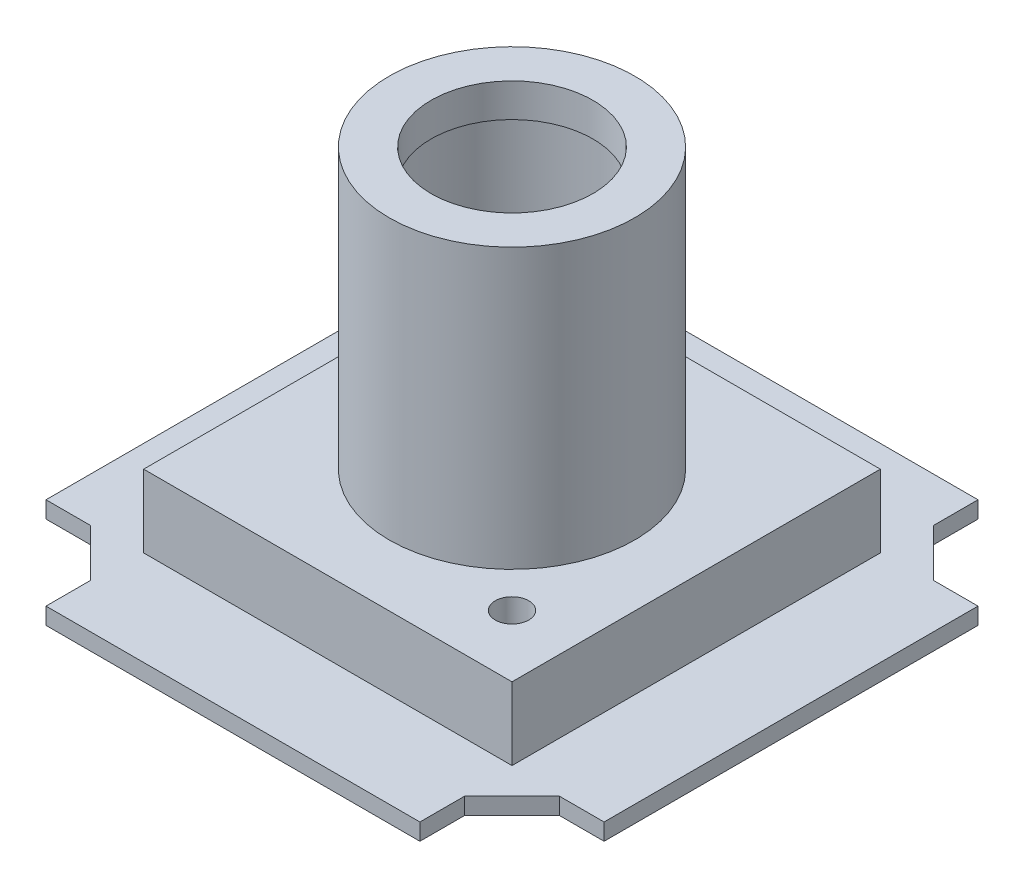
ISO-10303-21;
HEADER;
FILE_DESCRIPTION(('STEP AP214'),'2;1');
FILE_NAME('part.step','',(''),(''),'','','');
FILE_SCHEMA(('AUTOMOTIVE_DESIGN { 1 0 10303 214 1 1 1 1 }'));
ENDSEC;
DATA;
#1=APPLICATION_CONTEXT('core data for automotive mechanical design processes');
#2=APPLICATION_PROTOCOL_DEFINITION('international standard','automotive_design',2000,#1);
#3=PRODUCT_CONTEXT('',#1,'mechanical');
#4=PRODUCT('Part','Part','',(#3));
#5=PRODUCT_RELATED_PRODUCT_CATEGORY('part','',(#4));
#6=PRODUCT_DEFINITION_FORMATION('','',#4);
#7=PRODUCT_DEFINITION_CONTEXT('part definition',#1,'design');
#8=PRODUCT_DEFINITION('design','',#6,#7);
#9=PRODUCT_DEFINITION_SHAPE('','',#8);
#10=(LENGTH_UNIT() NAMED_UNIT(*) SI_UNIT(.MILLI.,.METRE.));
#11=(NAMED_UNIT(*) PLANE_ANGLE_UNIT() SI_UNIT($,.RADIAN.));
#12=(NAMED_UNIT(*) SI_UNIT($,.STERADIAN.) SOLID_ANGLE_UNIT());
#13=UNCERTAINTY_MEASURE_WITH_UNIT(LENGTH_MEASURE(1.E-05),#10,'distance_accuracy_value','');
#14=(GEOMETRIC_REPRESENTATION_CONTEXT(3) GLOBAL_UNCERTAINTY_ASSIGNED_CONTEXT((#13)) GLOBAL_UNIT_ASSIGNED_CONTEXT((#10,
#11,#12)) REPRESENTATION_CONTEXT('',''));
#15=CARTESIAN_POINT('',(0.,0.,0.));
#16=DIRECTION('',(0.,0.,1.));
#17=DIRECTION('',(1.,0.,0.));
#18=AXIS2_PLACEMENT_3D('',#15,#16,#17);
#19=CARTESIAN_POINT('',(0.,8.,16.5));
#20=DIRECTION('',(0.,0.,-1.));
#21=DIRECTION('',(-1.,0.,0.));
#22=AXIS2_PLACEMENT_3D('',#19,#20,#21);
#23=PLANE('',#22);
#24=DIRECTION('',(0.,-1.,0.));
#25=VECTOR('',#24,1.);
#26=CARTESIAN_POINT('',(-16.5,8.,16.5));
#27=LINE('',#26,#25);
#28=CARTESIAN_POINT('',(-16.5,8.,16.5));
#29=VERTEX_POINT('',#28);
#30=CARTESIAN_POINT('',(-16.5,1.5,16.5));
#31=VERTEX_POINT('',#30);
#32=EDGE_CURVE('E200',#29,#31,#27,.T.);
#33=ORIENTED_EDGE('',*,*,#32,.T.);
#34=DIRECTION('',(1.,0.,0.));
#35=VECTOR('',#34,1.);
#36=CARTESIAN_POINT('',(0.,1.5,16.5));
#37=LINE('',#36,#35);
#38=CARTESIAN_POINT('',(16.5,1.5,16.5));
#39=VERTEX_POINT('',#38);
#40=EDGE_CURVE('E66',#31,#39,#37,.T.);
#41=ORIENTED_EDGE('',*,*,#40,.T.);
#42=DIRECTION('',(0.,-1.,0.));
#43=VECTOR('',#42,1.);
#44=CARTESIAN_POINT('',(16.5,8.,16.5));
#45=LINE('',#44,#43);
#46=CARTESIAN_POINT('',(16.5,8.,16.5));
#47=VERTEX_POINT('',#46);
#48=EDGE_CURVE('E12',#47,#39,#45,.T.);
#49=ORIENTED_EDGE('',*,*,#48,.F.);
#50=DIRECTION('',(1.,0.,0.));
#51=VECTOR('',#50,1.);
#52=CARTESIAN_POINT('',(0.,8.,16.5));
#53=LINE('',#52,#51);
#54=EDGE_CURVE('E391',#29,#47,#53,.T.);
#55=ORIENTED_EDGE('',*,*,#54,.F.);
#56=EDGE_LOOP('',(#33,#41,#49,#55));
#57=FACE_BOUND('',#56,.T.);
#58=ADVANCED_FACE('F51',(#57),#23,.F.);
#59=CARTESIAN_POINT('',(16.5,8.,0.));
#60=DIRECTION('',(-1.,0.,0.));
#61=DIRECTION('',(0.,0.,1.));
#62=AXIS2_PLACEMENT_3D('',#59,#60,#61);
#63=PLANE('',#62);
#64=ORIENTED_EDGE('',*,*,#48,.T.);
#65=DIRECTION('',(0.,0.,-1.));
#66=VECTOR('',#65,1.);
#67=CARTESIAN_POINT('',(16.5,1.5,0.));
#68=LINE('',#67,#66);
#69=CARTESIAN_POINT('',(16.5,1.5,-16.5));
#70=VERTEX_POINT('',#69);
#71=EDGE_CURVE('E72',#39,#70,#68,.T.);
#72=ORIENTED_EDGE('',*,*,#71,.T.);
#73=DIRECTION('',(0.,-1.,0.));
#74=VECTOR('',#73,1.);
#75=CARTESIAN_POINT('',(16.5,8.,-16.5));
#76=LINE('',#75,#74);
#77=CARTESIAN_POINT('',(16.5,8.,-16.5));
#78=VERTEX_POINT('',#77);
#79=EDGE_CURVE('E59',#78,#70,#76,.T.);
#80=ORIENTED_EDGE('',*,*,#79,.F.);
#81=DIRECTION('',(0.,0.,-1.));
#82=VECTOR('',#81,1.);
#83=CARTESIAN_POINT('',(16.5,8.,0.));
#84=LINE('',#83,#82);
#85=EDGE_CURVE('E395',#47,#78,#84,.T.);
#86=ORIENTED_EDGE('',*,*,#85,.F.);
#87=EDGE_LOOP('',(#64,#72,#80,#86));
#88=FACE_BOUND('',#87,.T.);
#89=ADVANCED_FACE('F408',(#88),#63,.F.);
#90=CARTESIAN_POINT('',(0.,8.,-16.5));
#91=DIRECTION('',(0.,0.,-1.));
#92=DIRECTION('',(-1.,0.,0.));
#93=AXIS2_PLACEMENT_3D('',#90,#91,#92);
#94=PLANE('',#93);
#95=DIRECTION('',(1.,0.,0.));
#96=VECTOR('',#95,1.);
#97=CARTESIAN_POINT('',(0.,1.5,-16.5));
#98=LINE('',#97,#96);
#99=CARTESIAN_POINT('',(-16.5,1.5,-16.5));
#100=VERTEX_POINT('',#99);
#101=EDGE_CURVE('E203',#100,#70,#98,.T.);
#102=ORIENTED_EDGE('',*,*,#101,.F.);
#103=DIRECTION('',(0.,-1.,0.));
#104=VECTOR('',#103,1.);
#105=CARTESIAN_POINT('',(-16.5,8.,-16.5));
#106=LINE('',#105,#104);
#107=CARTESIAN_POINT('',(-16.5,8.,-16.5));
#108=VERTEX_POINT('',#107);
#109=EDGE_CURVE('E189',#108,#100,#106,.T.);
#110=ORIENTED_EDGE('',*,*,#109,.F.);
#111=DIRECTION('',(1.,0.,0.));
#112=VECTOR('',#111,1.);
#113=CARTESIAN_POINT('',(0.,8.,-16.5));
#114=LINE('',#113,#112);
#115=EDGE_CURVE('E398',#108,#78,#114,.T.);
#116=ORIENTED_EDGE('',*,*,#115,.T.);
#117=ORIENTED_EDGE('',*,*,#79,.T.);
#118=EDGE_LOOP('',(#102,#110,#116,#117));
#119=FACE_BOUND('',#118,.T.);
#120=ADVANCED_FACE('F204',(#119),#94,.T.);
#121=CARTESIAN_POINT('',(-16.5,8.,0.));
#122=DIRECTION('',(-1.,0.,0.));
#123=DIRECTION('',(0.,0.,1.));
#124=AXIS2_PLACEMENT_3D('',#121,#122,#123);
#125=PLANE('',#124);
#126=DIRECTION('',(0.,0.,-1.));
#127=VECTOR('',#126,1.);
#128=CARTESIAN_POINT('',(-16.5,1.5,0.));
#129=LINE('',#128,#127);
#130=EDGE_CURVE('E193',#31,#100,#129,.T.);
#131=ORIENTED_EDGE('',*,*,#130,.F.);
#132=ORIENTED_EDGE('',*,*,#32,.F.);
#133=DIRECTION('',(0.,0.,-1.));
#134=VECTOR('',#133,1.);
#135=CARTESIAN_POINT('',(-16.5,8.,0.));
#136=LINE('',#135,#134);
#137=EDGE_CURVE('E195',#29,#108,#136,.T.);
#138=ORIENTED_EDGE('',*,*,#137,.T.);
#139=ORIENTED_EDGE('',*,*,#109,.T.);
#140=EDGE_LOOP('',(#131,#132,#138,#139));
#141=FACE_BOUND('',#140,.T.);
#142=ADVANCED_FACE('F191',(#141),#125,.T.);
#143=CARTESIAN_POINT('',(0.,8.,0.));
#144=DIRECTION('',(0.,1.,0.));
#145=DIRECTION('',(0.,0.,1.));
#146=AXIS2_PLACEMENT_3D('',#143,#144,#145);
#147=PLANE('',#146);
#148=CARTESIAN_POINT('',(0.,8.,0.));
#149=DIRECTION('',(0.,1.,0.));
#150=DIRECTION('',(0.,0.,1.));
#151=AXIS2_PLACEMENT_3D('',#148,#149,#150);
#152=CIRCLE('',#151,11.);
#153=CARTESIAN_POINT('',(0.,8.,11.));
#154=VERTEX_POINT('',#153);
#155=EDGE_CURVE('E541',#154,#154,#152,.T.);
#156=ORIENTED_EDGE('',*,*,#155,.F.);
#157=EDGE_LOOP('',(#156));
#158=FACE_BOUND('',#157,.T.);
#159=CARTESIAN_POINT('',(-10.9601551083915,8.,-10.9601551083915));
#160=DIRECTION('',(0.,1.,0.));
#161=DIRECTION('',(0.,0.,1.));
#162=AXIS2_PLACEMENT_3D('',#159,#160,#161);
#163=CIRCLE('',#162,1.5);
#164=CARTESIAN_POINT('',(-10.9601551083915,8.,-9.46015510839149));
#165=VERTEX_POINT('',#164);
#166=EDGE_CURVE('E284',#165,#165,#163,.T.);
#167=ORIENTED_EDGE('',*,*,#166,.F.);
#168=EDGE_LOOP('',(#167));
#169=FACE_BOUND('',#168,.T.);
#170=CARTESIAN_POINT('',(10.9601551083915,8.,10.9601551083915));
#171=DIRECTION('',(0.,1.,0.));
#172=DIRECTION('',(0.,0.,1.));
#173=AXIS2_PLACEMENT_3D('',#170,#171,#172);
#174=CIRCLE('',#173,1.5);
#175=CARTESIAN_POINT('',(10.9601551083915,8.,12.4601551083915));
#176=VERTEX_POINT('',#175);
#177=EDGE_CURVE('E554',#176,#176,#174,.T.);
#178=ORIENTED_EDGE('',*,*,#177,.F.);
#179=EDGE_LOOP('',(#178));
#180=FACE_BOUND('',#179,.T.);
#181=ORIENTED_EDGE('',*,*,#54,.T.);
#182=ORIENTED_EDGE('',*,*,#85,.T.);
#183=ORIENTED_EDGE('',*,*,#115,.F.);
#184=ORIENTED_EDGE('',*,*,#137,.F.);
#185=EDGE_LOOP('',(#181,#182,#183,#184));
#186=FACE_BOUND('',#185,.T.);
#187=ADVANCED_FACE('F407',(#158,#169,#180,#186),#147,.T.);
#188=CARTESIAN_POINT('',(0.,1.5,-16.75));
#189=DIRECTION('',(0.,0.,-1.));
#190=DIRECTION('',(-1.,0.,0.));
#191=AXIS2_PLACEMENT_3D('',#188,#189,#190);
#192=PLANE('',#191);
#193=DIRECTION('',(1.,0.,0.));
#194=VECTOR('',#193,1.);
#195=CARTESIAN_POINT('',(0.,0.,-16.75));
#196=LINE('',#195,#194);
#197=CARTESIAN_POINT('',(-25.,0.,-16.75));
#198=VERTEX_POINT('',#197);
#199=CARTESIAN_POINT('',(-21.,0.,-16.75));
#200=VERTEX_POINT('',#199);
#201=EDGE_CURVE('E279',#198,#200,#196,.T.);
#202=ORIENTED_EDGE('',*,*,#201,.F.);
#203=DIRECTION('',(0.,-1.,0.));
#204=VECTOR('',#203,1.);
#205=CARTESIAN_POINT('',(-25.,1.5,-16.75));
#206=LINE('',#205,#204);
#207=CARTESIAN_POINT('',(-25.,1.5,-16.75));
#208=VERTEX_POINT('',#207);
#209=EDGE_CURVE('E388',#208,#198,#206,.T.);
#210=ORIENTED_EDGE('',*,*,#209,.F.);
#211=DIRECTION('',(1.,0.,0.));
#212=VECTOR('',#211,1.);
#213=CARTESIAN_POINT('',(0.,1.5,-16.75));
#214=LINE('',#213,#212);
#215=CARTESIAN_POINT('',(-21.,1.5,-16.75));
#216=VERTEX_POINT('',#215);
#217=EDGE_CURVE('E207',#208,#216,#214,.T.);
#218=ORIENTED_EDGE('',*,*,#217,.T.);
#219=DIRECTION('',(0.,-1.,0.));
#220=VECTOR('',#219,1.);
#221=CARTESIAN_POINT('',(-21.,1.5,-16.75));
#222=LINE('',#221,#220);
#223=EDGE_CURVE('E278',#216,#200,#222,.T.);
#224=ORIENTED_EDGE('',*,*,#223,.T.);
#225=EDGE_LOOP('',(#202,#210,#218,#224));
#226=FACE_BOUND('',#225,.T.);
#227=ADVANCED_FACE('F425',(#226),#192,.T.);
#228=CARTESIAN_POINT('',(-25.,1.5,0.));
#229=DIRECTION('',(1.,0.,0.));
#230=DIRECTION('',(0.,0.,-1.));
#231=AXIS2_PLACEMENT_3D('',#228,#229,#230);
#232=PLANE('',#231);
#233=DIRECTION('',(0.,0.,1.));
#234=VECTOR('',#233,1.);
#235=CARTESIAN_POINT('',(-25.,0.,0.));
#236=LINE('',#235,#234);
#237=CARTESIAN_POINT('',(-25.,0.,16.75));
#238=VERTEX_POINT('',#237);
#239=EDGE_CURVE('E283',#198,#238,#236,.T.);
#240=ORIENTED_EDGE('',*,*,#239,.T.);
#241=DIRECTION('',(0.,-1.,0.));
#242=VECTOR('',#241,1.);
#243=CARTESIAN_POINT('',(-25.,1.5,16.75));
#244=LINE('',#243,#242);
#245=CARTESIAN_POINT('',(-25.,1.5,16.75));
#246=VERTEX_POINT('',#245);
#247=EDGE_CURVE('E385',#246,#238,#244,.T.);
#248=ORIENTED_EDGE('',*,*,#247,.F.);
#249=DIRECTION('',(0.,0.,1.));
#250=VECTOR('',#249,1.);
#251=CARTESIAN_POINT('',(-25.,1.5,0.));
#252=LINE('',#251,#250);
#253=EDGE_CURVE('E220',#208,#246,#252,.T.);
#254=ORIENTED_EDGE('',*,*,#253,.F.);
#255=ORIENTED_EDGE('',*,*,#209,.T.);
#256=EDGE_LOOP('',(#240,#248,#254,#255));
#257=FACE_BOUND('',#256,.T.);
#258=ADVANCED_FACE('F429',(#257),#232,.F.);
#259=CARTESIAN_POINT('',(0.,1.5,16.75));
#260=DIRECTION('',(0.,0.,1.));
#261=DIRECTION('',(1.,0.,0.));
#262=AXIS2_PLACEMENT_3D('',#259,#260,#261);
#263=PLANE('',#262);
#264=DIRECTION('',(-1.,0.,0.));
#265=VECTOR('',#264,1.);
#266=CARTESIAN_POINT('',(0.,0.,16.75));
#267=LINE('',#266,#265);
#268=CARTESIAN_POINT('',(-21.,0.,16.75));
#269=VERTEX_POINT('',#268);
#270=EDGE_CURVE('E288',#269,#238,#267,.T.);
#271=ORIENTED_EDGE('',*,*,#270,.F.);
#272=DIRECTION('',(0.,-1.,0.));
#273=VECTOR('',#272,1.);
#274=CARTESIAN_POINT('',(-21.,1.5,16.75));
#275=LINE('',#274,#273);
#276=CARTESIAN_POINT('',(-21.,1.5,16.75));
#277=VERTEX_POINT('',#276);
#278=EDGE_CURVE('E382',#277,#269,#275,.T.);
#279=ORIENTED_EDGE('',*,*,#278,.F.);
#280=DIRECTION('',(-1.,0.,0.));
#281=VECTOR('',#280,1.);
#282=CARTESIAN_POINT('',(0.,1.5,16.75));
#283=LINE('',#282,#281);
#284=EDGE_CURVE('E223',#277,#246,#283,.T.);
#285=ORIENTED_EDGE('',*,*,#284,.T.);
#286=ORIENTED_EDGE('',*,*,#247,.T.);
#287=EDGE_LOOP('',(#271,#279,#285,#286));
#288=FACE_BOUND('',#287,.T.);
#289=ADVANCED_FACE('F433',(#288),#263,.T.);
#290=CARTESIAN_POINT('',(-18.875,1.5,18.875));
#291=DIRECTION('',(-0.707106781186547,0.,0.707106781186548));
#292=DIRECTION('',(0.707106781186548,0.,0.707106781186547));
#293=AXIS2_PLACEMENT_3D('',#290,#291,#292);
#294=PLANE('',#293);
#295=DIRECTION('',(-0.707106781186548,0.,-0.707106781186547));
#296=VECTOR('',#295,1.);
#297=CARTESIAN_POINT('',(-18.875,0.,18.875));
#298=LINE('',#297,#296);
#299=CARTESIAN_POINT('',(-16.75,0.,21.));
#300=VERTEX_POINT('',#299);
#301=EDGE_CURVE('E292',#300,#269,#298,.T.);
#302=ORIENTED_EDGE('',*,*,#301,.F.);
#303=DIRECTION('',(0.,-1.,0.));
#304=VECTOR('',#303,1.);
#305=CARTESIAN_POINT('',(-16.75,1.5,21.));
#306=LINE('',#305,#304);
#307=CARTESIAN_POINT('',(-16.75,1.5,21.));
#308=VERTEX_POINT('',#307);
#309=EDGE_CURVE('E379',#308,#300,#306,.T.);
#310=ORIENTED_EDGE('',*,*,#309,.F.);
#311=DIRECTION('',(-0.707106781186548,0.,-0.707106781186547));
#312=VECTOR('',#311,1.);
#313=CARTESIAN_POINT('',(-18.875,1.5,18.875));
#314=LINE('',#313,#312);
#315=EDGE_CURVE('E227',#308,#277,#314,.T.);
#316=ORIENTED_EDGE('',*,*,#315,.T.);
#317=ORIENTED_EDGE('',*,*,#278,.T.);
#318=EDGE_LOOP('',(#302,#310,#316,#317));
#319=FACE_BOUND('',#318,.T.);
#320=ADVANCED_FACE('F437',(#319),#294,.T.);
#321=CARTESIAN_POINT('',(-16.75,1.5,0.));
#322=DIRECTION('',(-1.,0.,0.));
#323=DIRECTION('',(0.,0.,1.));
#324=AXIS2_PLACEMENT_3D('',#321,#322,#323);
#325=PLANE('',#324);
#326=DIRECTION('',(0.,0.,-1.));
#327=VECTOR('',#326,1.);
#328=CARTESIAN_POINT('',(-16.75,0.,0.));
#329=LINE('',#328,#327);
#330=CARTESIAN_POINT('',(-16.75,0.,25.));
#331=VERTEX_POINT('',#330);
#332=EDGE_CURVE('E296',#331,#300,#329,.T.);
#333=ORIENTED_EDGE('',*,*,#332,.F.);
#334=DIRECTION('',(0.,-1.,0.));
#335=VECTOR('',#334,1.);
#336=CARTESIAN_POINT('',(-16.75,1.5,25.));
#337=LINE('',#336,#335);
#338=CARTESIAN_POINT('',(-16.75,1.5,25.));
#339=VERTEX_POINT('',#338);
#340=EDGE_CURVE('E376',#339,#331,#337,.T.);
#341=ORIENTED_EDGE('',*,*,#340,.F.);
#342=DIRECTION('',(0.,0.,-1.));
#343=VECTOR('',#342,1.);
#344=CARTESIAN_POINT('',(-16.75,1.5,0.));
#345=LINE('',#344,#343);
#346=EDGE_CURVE('E231',#339,#308,#345,.T.);
#347=ORIENTED_EDGE('',*,*,#346,.T.);
#348=ORIENTED_EDGE('',*,*,#309,.T.);
#349=EDGE_LOOP('',(#333,#341,#347,#348));
#350=FACE_BOUND('',#349,.T.);
#351=ADVANCED_FACE('F441',(#350),#325,.T.);
#352=CARTESIAN_POINT('',(0.,1.5,25.));
#353=DIRECTION('',(0.,0.,1.));
#354=DIRECTION('',(1.,0.,0.));
#355=AXIS2_PLACEMENT_3D('',#352,#353,#354);
#356=PLANE('',#355);
#357=DIRECTION('',(-1.,0.,0.));
#358=VECTOR('',#357,1.);
#359=CARTESIAN_POINT('',(0.,0.,25.));
#360=LINE('',#359,#358);
#361=CARTESIAN_POINT('',(16.75,0.,25.));
#362=VERTEX_POINT('',#361);
#363=EDGE_CURVE('E300',#362,#331,#360,.T.);
#364=ORIENTED_EDGE('',*,*,#363,.F.);
#365=DIRECTION('',(0.,-1.,0.));
#366=VECTOR('',#365,1.);
#367=CARTESIAN_POINT('',(16.75,1.5,25.));
#368=LINE('',#367,#366);
#369=CARTESIAN_POINT('',(16.75,1.5,25.));
#370=VERTEX_POINT('',#369);
#371=EDGE_CURVE('E373',#370,#362,#368,.T.);
#372=ORIENTED_EDGE('',*,*,#371,.F.);
#373=DIRECTION('',(-1.,0.,0.));
#374=VECTOR('',#373,1.);
#375=CARTESIAN_POINT('',(0.,1.5,25.));
#376=LINE('',#375,#374);
#377=EDGE_CURVE('E235',#370,#339,#376,.T.);
#378=ORIENTED_EDGE('',*,*,#377,.T.);
#379=ORIENTED_EDGE('',*,*,#340,.T.);
#380=EDGE_LOOP('',(#364,#372,#378,#379));
#381=FACE_BOUND('',#380,.T.);
#382=ADVANCED_FACE('F445',(#381),#356,.T.);
#383=CARTESIAN_POINT('',(16.75,1.5,0.));
#384=DIRECTION('',(1.,0.,0.));
#385=DIRECTION('',(0.,0.,-1.));
#386=AXIS2_PLACEMENT_3D('',#383,#384,#385);
#387=PLANE('',#386);
#388=DIRECTION('',(0.,0.,1.));
#389=VECTOR('',#388,1.);
#390=CARTESIAN_POINT('',(16.75,0.,0.));
#391=LINE('',#390,#389);
#392=CARTESIAN_POINT('',(16.75,0.,21.));
#393=VERTEX_POINT('',#392);
#394=EDGE_CURVE('E304',#393,#362,#391,.T.);
#395=ORIENTED_EDGE('',*,*,#394,.F.);
#396=DIRECTION('',(0.,-1.,0.));
#397=VECTOR('',#396,1.);
#398=CARTESIAN_POINT('',(16.75,1.5,21.));
#399=LINE('',#398,#397);
#400=CARTESIAN_POINT('',(16.75,1.5,21.));
#401=VERTEX_POINT('',#400);
#402=EDGE_CURVE('E370',#401,#393,#399,.T.);
#403=ORIENTED_EDGE('',*,*,#402,.F.);
#404=DIRECTION('',(0.,0.,1.));
#405=VECTOR('',#404,1.);
#406=CARTESIAN_POINT('',(16.75,1.5,0.));
#407=LINE('',#406,#405);
#408=EDGE_CURVE('E239',#401,#370,#407,.T.);
#409=ORIENTED_EDGE('',*,*,#408,.T.);
#410=ORIENTED_EDGE('',*,*,#371,.T.);
#411=EDGE_LOOP('',(#395,#403,#409,#410));
#412=FACE_BOUND('',#411,.T.);
#413=ADVANCED_FACE('F449',(#412),#387,.T.);
#414=CARTESIAN_POINT('',(18.875,1.5,18.875));
#415=DIRECTION('',(0.707106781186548,0.,0.707106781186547));
#416=DIRECTION('',(0.707106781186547,0.,-0.707106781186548));
#417=AXIS2_PLACEMENT_3D('',#414,#415,#416);
#418=PLANE('',#417);
#419=DIRECTION('',(-0.707106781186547,0.,0.707106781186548));
#420=VECTOR('',#419,1.);
#421=CARTESIAN_POINT('',(18.875,0.,18.875));
#422=LINE('',#421,#420);
#423=CARTESIAN_POINT('',(21.,0.,16.75));
#424=VERTEX_POINT('',#423);
#425=EDGE_CURVE('E308',#424,#393,#422,.T.);
#426=ORIENTED_EDGE('',*,*,#425,.F.);
#427=DIRECTION('',(0.,-1.,0.));
#428=VECTOR('',#427,1.);
#429=CARTESIAN_POINT('',(21.,1.5,16.75));
#430=LINE('',#429,#428);
#431=CARTESIAN_POINT('',(21.,1.5,16.75));
#432=VERTEX_POINT('',#431);
#433=EDGE_CURVE('E367',#432,#424,#430,.T.);
#434=ORIENTED_EDGE('',*,*,#433,.F.);
#435=DIRECTION('',(-0.707106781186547,0.,0.707106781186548));
#436=VECTOR('',#435,1.);
#437=CARTESIAN_POINT('',(18.875,1.5,18.875));
#438=LINE('',#437,#436);
#439=EDGE_CURVE('E243',#432,#401,#438,.T.);
#440=ORIENTED_EDGE('',*,*,#439,.T.);
#441=ORIENTED_EDGE('',*,*,#402,.T.);
#442=EDGE_LOOP('',(#426,#434,#440,#441));
#443=FACE_BOUND('',#442,.T.);
#444=ADVANCED_FACE('F453',(#443),#418,.T.);
#445=CARTESIAN_POINT('',(0.,1.5,16.75));
#446=DIRECTION('',(0.,0.,1.));
#447=DIRECTION('',(1.,0.,0.));
#448=AXIS2_PLACEMENT_3D('',#445,#446,#447);
#449=PLANE('',#448);
#450=DIRECTION('',(-1.,0.,0.));
#451=VECTOR('',#450,1.);
#452=CARTESIAN_POINT('',(0.,0.,16.75));
#453=LINE('',#452,#451);
#454=CARTESIAN_POINT('',(25.,0.,16.75));
#455=VERTEX_POINT('',#454);
#456=EDGE_CURVE('E312',#455,#424,#453,.T.);
#457=ORIENTED_EDGE('',*,*,#456,.F.);
#458=DIRECTION('',(0.,-1.,0.));
#459=VECTOR('',#458,1.);
#460=CARTESIAN_POINT('',(25.,1.5,16.75));
#461=LINE('',#460,#459);
#462=CARTESIAN_POINT('',(25.,1.5,16.75));
#463=VERTEX_POINT('',#462);
#464=EDGE_CURVE('E364',#463,#455,#461,.T.);
#465=ORIENTED_EDGE('',*,*,#464,.F.);
#466=DIRECTION('',(-1.,0.,0.));
#467=VECTOR('',#466,1.);
#468=CARTESIAN_POINT('',(0.,1.5,16.75));
#469=LINE('',#468,#467);
#470=EDGE_CURVE('E247',#463,#432,#469,.T.);
#471=ORIENTED_EDGE('',*,*,#470,.T.);
#472=ORIENTED_EDGE('',*,*,#433,.T.);
#473=EDGE_LOOP('',(#457,#465,#471,#472));
#474=FACE_BOUND('',#473,.T.);
#475=ADVANCED_FACE('F457',(#474),#449,.T.);
#476=CARTESIAN_POINT('',(25.,1.5,0.));
#477=DIRECTION('',(1.,0.,0.));
#478=DIRECTION('',(0.,0.,-1.));
#479=AXIS2_PLACEMENT_3D('',#476,#477,#478);
#480=PLANE('',#479);
#481=DIRECTION('',(0.,0.,1.));
#482=VECTOR('',#481,1.);
#483=CARTESIAN_POINT('',(25.,0.,0.));
#484=LINE('',#483,#482);
#485=CARTESIAN_POINT('',(25.,0.,-16.75));
#486=VERTEX_POINT('',#485);
#487=EDGE_CURVE('E316',#486,#455,#484,.T.);
#488=ORIENTED_EDGE('',*,*,#487,.F.);
#489=DIRECTION('',(0.,-1.,0.));
#490=VECTOR('',#489,1.);
#491=CARTESIAN_POINT('',(25.,1.5,-16.75));
#492=LINE('',#491,#490);
#493=CARTESIAN_POINT('',(25.,1.5,-16.75));
#494=VERTEX_POINT('',#493);
#495=EDGE_CURVE('E361',#494,#486,#492,.T.);
#496=ORIENTED_EDGE('',*,*,#495,.F.);
#497=DIRECTION('',(0.,0.,1.));
#498=VECTOR('',#497,1.);
#499=CARTESIAN_POINT('',(25.,1.5,0.));
#500=LINE('',#499,#498);
#501=EDGE_CURVE('E251',#494,#463,#500,.T.);
#502=ORIENTED_EDGE('',*,*,#501,.T.);
#503=ORIENTED_EDGE('',*,*,#464,.T.);
#504=EDGE_LOOP('',(#488,#496,#502,#503));
#505=FACE_BOUND('',#504,.T.);
#506=ADVANCED_FACE('F461',(#505),#480,.T.);
#507=CARTESIAN_POINT('',(0.,1.5,-16.75));
#508=DIRECTION('',(0.,0.,-1.));
#509=DIRECTION('',(-1.,0.,0.));
#510=AXIS2_PLACEMENT_3D('',#507,#508,#509);
#511=PLANE('',#510);
#512=DIRECTION('',(1.,0.,0.));
#513=VECTOR('',#512,1.);
#514=CARTESIAN_POINT('',(0.,0.,-16.75));
#515=LINE('',#514,#513);
#516=CARTESIAN_POINT('',(21.,0.,-16.75));
#517=VERTEX_POINT('',#516);
#518=EDGE_CURVE('E320',#517,#486,#515,.T.);
#519=ORIENTED_EDGE('',*,*,#518,.F.);
#520=DIRECTION('',(0.,-1.,0.));
#521=VECTOR('',#520,1.);
#522=CARTESIAN_POINT('',(21.,1.5,-16.75));
#523=LINE('',#522,#521);
#524=CARTESIAN_POINT('',(21.,1.5,-16.75));
#525=VERTEX_POINT('',#524);
#526=EDGE_CURVE('E358',#525,#517,#523,.T.);
#527=ORIENTED_EDGE('',*,*,#526,.F.);
#528=DIRECTION('',(1.,0.,0.));
#529=VECTOR('',#528,1.);
#530=CARTESIAN_POINT('',(0.,1.5,-16.75));
#531=LINE('',#530,#529);
#532=EDGE_CURVE('E255',#525,#494,#531,.T.);
#533=ORIENTED_EDGE('',*,*,#532,.T.);
#534=ORIENTED_EDGE('',*,*,#495,.T.);
#535=EDGE_LOOP('',(#519,#527,#533,#534));
#536=FACE_BOUND('',#535,.T.);
#537=ADVANCED_FACE('F465',(#536),#511,.T.);
#538=CARTESIAN_POINT('',(18.875,1.5,-18.875));
#539=DIRECTION('',(0.707106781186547,0.,-0.707106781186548));
#540=DIRECTION('',(-0.707106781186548,0.,-0.707106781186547));
#541=AXIS2_PLACEMENT_3D('',#538,#539,#540);
#542=PLANE('',#541);
#543=DIRECTION('',(0.707106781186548,0.,0.707106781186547));
#544=VECTOR('',#543,1.);
#545=CARTESIAN_POINT('',(18.875,0.,-18.875));
#546=LINE('',#545,#544);
#547=CARTESIAN_POINT('',(16.75,0.,-21.));
#548=VERTEX_POINT('',#547);
#549=EDGE_CURVE('E324',#548,#517,#546,.T.);
#550=ORIENTED_EDGE('',*,*,#549,.F.);
#551=DIRECTION('',(0.,-1.,0.));
#552=VECTOR('',#551,1.);
#553=CARTESIAN_POINT('',(16.75,1.5,-21.));
#554=LINE('',#553,#552);
#555=CARTESIAN_POINT('',(16.75,1.5,-21.));
#556=VERTEX_POINT('',#555);
#557=EDGE_CURVE('E355',#556,#548,#554,.T.);
#558=ORIENTED_EDGE('',*,*,#557,.F.);
#559=DIRECTION('',(0.707106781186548,0.,0.707106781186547));
#560=VECTOR('',#559,1.);
#561=CARTESIAN_POINT('',(18.875,1.5,-18.875));
#562=LINE('',#561,#560);
#563=EDGE_CURVE('E259',#556,#525,#562,.T.);
#564=ORIENTED_EDGE('',*,*,#563,.T.);
#565=ORIENTED_EDGE('',*,*,#526,.T.);
#566=EDGE_LOOP('',(#550,#558,#564,#565));
#567=FACE_BOUND('',#566,.T.);
#568=ADVANCED_FACE('F469',(#567),#542,.T.);
#569=CARTESIAN_POINT('',(16.75,1.5,0.));
#570=DIRECTION('',(1.,0.,0.));
#571=DIRECTION('',(0.,0.,-1.));
#572=AXIS2_PLACEMENT_3D('',#569,#570,#571);
#573=PLANE('',#572);
#574=DIRECTION('',(0.,0.,1.));
#575=VECTOR('',#574,1.);
#576=CARTESIAN_POINT('',(16.75,0.,0.));
#577=LINE('',#576,#575);
#578=CARTESIAN_POINT('',(16.75,0.,-25.));
#579=VERTEX_POINT('',#578);
#580=EDGE_CURVE('E328',#579,#548,#577,.T.);
#581=ORIENTED_EDGE('',*,*,#580,.F.);
#582=DIRECTION('',(0.,-1.,0.));
#583=VECTOR('',#582,1.);
#584=CARTESIAN_POINT('',(16.75,1.5,-25.));
#585=LINE('',#584,#583);
#586=CARTESIAN_POINT('',(16.75,1.5,-25.));
#587=VERTEX_POINT('',#586);
#588=EDGE_CURVE('E352',#587,#579,#585,.T.);
#589=ORIENTED_EDGE('',*,*,#588,.F.);
#590=DIRECTION('',(0.,0.,1.));
#591=VECTOR('',#590,1.);
#592=CARTESIAN_POINT('',(16.75,1.5,0.));
#593=LINE('',#592,#591);
#594=EDGE_CURVE('E263',#587,#556,#593,.T.);
#595=ORIENTED_EDGE('',*,*,#594,.T.);
#596=ORIENTED_EDGE('',*,*,#557,.T.);
#597=EDGE_LOOP('',(#581,#589,#595,#596));
#598=FACE_BOUND('',#597,.T.);
#599=ADVANCED_FACE('F473',(#598),#573,.T.);
#600=CARTESIAN_POINT('',(0.,1.5,-25.));
#601=DIRECTION('',(0.,0.,1.));
#602=DIRECTION('',(1.,0.,0.));
#603=AXIS2_PLACEMENT_3D('',#600,#601,#602);
#604=PLANE('',#603);
#605=DIRECTION('',(-1.,0.,0.));
#606=VECTOR('',#605,1.);
#607=CARTESIAN_POINT('',(0.,0.,-25.));
#608=LINE('',#607,#606);
#609=CARTESIAN_POINT('',(-16.75,0.,-25.));
#610=VERTEX_POINT('',#609);
#611=EDGE_CURVE('E332',#579,#610,#608,.T.);
#612=ORIENTED_EDGE('',*,*,#611,.T.);
#613=DIRECTION('',(0.,-1.,0.));
#614=VECTOR('',#613,1.);
#615=CARTESIAN_POINT('',(-16.75,1.5,-25.));
#616=LINE('',#615,#614);
#617=CARTESIAN_POINT('',(-16.75,1.5,-25.));
#618=VERTEX_POINT('',#617);
#619=EDGE_CURVE('E349',#618,#610,#616,.T.);
#620=ORIENTED_EDGE('',*,*,#619,.F.);
#621=DIRECTION('',(-1.,0.,0.));
#622=VECTOR('',#621,1.);
#623=CARTESIAN_POINT('',(0.,1.5,-25.));
#624=LINE('',#623,#622);
#625=EDGE_CURVE('E267',#587,#618,#624,.T.);
#626=ORIENTED_EDGE('',*,*,#625,.F.);
#627=ORIENTED_EDGE('',*,*,#588,.T.);
#628=EDGE_LOOP('',(#612,#620,#626,#627));
#629=FACE_BOUND('',#628,.T.);
#630=ADVANCED_FACE('F477',(#629),#604,.F.);
#631=CARTESIAN_POINT('',(-16.75,1.5,0.));
#632=DIRECTION('',(-1.,0.,0.));
#633=DIRECTION('',(0.,0.,1.));
#634=AXIS2_PLACEMENT_3D('',#631,#632,#633);
#635=PLANE('',#634);
#636=DIRECTION('',(0.,0.,-1.));
#637=VECTOR('',#636,1.);
#638=CARTESIAN_POINT('',(-16.75,0.,0.));
#639=LINE('',#638,#637);
#640=CARTESIAN_POINT('',(-16.75,0.,-21.));
#641=VERTEX_POINT('',#640);
#642=EDGE_CURVE('E336',#641,#610,#639,.T.);
#643=ORIENTED_EDGE('',*,*,#642,.F.);
#644=DIRECTION('',(0.,-1.,0.));
#645=VECTOR('',#644,1.);
#646=CARTESIAN_POINT('',(-16.75,1.5,-21.));
#647=LINE('',#646,#645);
#648=CARTESIAN_POINT('',(-16.75,1.5,-21.));
#649=VERTEX_POINT('',#648);
#650=EDGE_CURVE('E346',#649,#641,#647,.T.);
#651=ORIENTED_EDGE('',*,*,#650,.F.);
#652=DIRECTION('',(0.,0.,-1.));
#653=VECTOR('',#652,1.);
#654=CARTESIAN_POINT('',(-16.75,1.5,0.));
#655=LINE('',#654,#653);
#656=EDGE_CURVE('E270',#649,#618,#655,.T.);
#657=ORIENTED_EDGE('',*,*,#656,.T.);
#658=ORIENTED_EDGE('',*,*,#619,.T.);
#659=EDGE_LOOP('',(#643,#651,#657,#658));
#660=FACE_BOUND('',#659,.T.);
#661=ADVANCED_FACE('F481',(#660),#635,.T.);
#662=CARTESIAN_POINT('',(-18.875,1.5,-18.875));
#663=DIRECTION('',(-0.707106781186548,0.,-0.707106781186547));
#664=DIRECTION('',(-0.707106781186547,0.,0.707106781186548));
#665=AXIS2_PLACEMENT_3D('',#662,#663,#664);
#666=PLANE('',#665);
#667=DIRECTION('',(0.707106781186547,0.,-0.707106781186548));
#668=VECTOR('',#667,1.);
#669=CARTESIAN_POINT('',(-18.875,0.,-18.875));
#670=LINE('',#669,#668);
#671=EDGE_CURVE('E340',#200,#641,#670,.T.);
#672=ORIENTED_EDGE('',*,*,#671,.F.);
#673=ORIENTED_EDGE('',*,*,#223,.F.);
#674=DIRECTION('',(0.707106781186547,0.,-0.707106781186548));
#675=VECTOR('',#674,1.);
#676=CARTESIAN_POINT('',(-18.875,1.5,-18.875));
#677=LINE('',#676,#675);
#678=EDGE_CURVE('E274',#216,#649,#677,.T.);
#679=ORIENTED_EDGE('',*,*,#678,.T.);
#680=ORIENTED_EDGE('',*,*,#650,.T.);
#681=EDGE_LOOP('',(#672,#673,#679,#680));
#682=FACE_BOUND('',#681,.T.);
#683=ADVANCED_FACE('F485',(#682),#666,.T.);
#684=CARTESIAN_POINT('',(0.,1.5,0.));
#685=DIRECTION('',(0.,1.,0.));
#686=DIRECTION('',(0.,0.,1.));
#687=AXIS2_PLACEMENT_3D('',#684,#685,#686);
#688=PLANE('',#687);
#689=ORIENTED_EDGE('',*,*,#71,.F.);
#690=ORIENTED_EDGE('',*,*,#40,.F.);
#691=ORIENTED_EDGE('',*,*,#130,.T.);
#692=ORIENTED_EDGE('',*,*,#101,.T.);
#693=EDGE_LOOP('',(#689,#690,#691,#692));
#694=FACE_BOUND('',#693,.T.);
#695=ORIENTED_EDGE('',*,*,#217,.F.);
#696=ORIENTED_EDGE('',*,*,#253,.T.);
#697=ORIENTED_EDGE('',*,*,#284,.F.);
#698=ORIENTED_EDGE('',*,*,#315,.F.);
#699=ORIENTED_EDGE('',*,*,#346,.F.);
#700=ORIENTED_EDGE('',*,*,#377,.F.);
#701=ORIENTED_EDGE('',*,*,#408,.F.);
#702=ORIENTED_EDGE('',*,*,#439,.F.);
#703=ORIENTED_EDGE('',*,*,#470,.F.);
#704=ORIENTED_EDGE('',*,*,#501,.F.);
#705=ORIENTED_EDGE('',*,*,#532,.F.);
#706=ORIENTED_EDGE('',*,*,#563,.F.);
#707=ORIENTED_EDGE('',*,*,#594,.F.);
#708=ORIENTED_EDGE('',*,*,#625,.T.);
#709=ORIENTED_EDGE('',*,*,#656,.F.);
#710=ORIENTED_EDGE('',*,*,#678,.F.);
#711=EDGE_LOOP('',(#695,#696,#697,#698,#699,#700,#701,#702,#703,#704,#705,#706,#707,#708,#709,#710));
#712=FACE_BOUND('',#711,.T.);
#713=ADVANCED_FACE('F209',(#694,#712),#688,.T.);
#714=CARTESIAN_POINT('',(0.,0.,0.));
#715=DIRECTION('',(0.,1.,0.));
#716=DIRECTION('',(0.,0.,1.));
#717=AXIS2_PLACEMENT_3D('',#714,#715,#716);
#718=PLANE('',#717);
#719=CARTESIAN_POINT('',(0.,0.,0.));
#720=DIRECTION('',(0.,1.,0.));
#721=DIRECTION('',(0.,0.,1.));
#722=AXIS2_PLACEMENT_3D('',#719,#720,#721);
#723=CIRCLE('',#722,9.);
#724=CARTESIAN_POINT('',(0.,0.,9.));
#725=VERTEX_POINT('',#724);
#726=EDGE_CURVE('E529',#725,#725,#723,.T.);
#727=ORIENTED_EDGE('',*,*,#726,.T.);
#728=EDGE_LOOP('',(#727));
#729=FACE_BOUND('',#728,.T.);
#730=CARTESIAN_POINT('',(-10.9601551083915,0.,-10.9601551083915));
#731=DIRECTION('',(0.,1.,0.));
#732=DIRECTION('',(0.,0.,1.));
#733=AXIS2_PLACEMENT_3D('',#730,#731,#732);
#734=CIRCLE('',#733,1.5);
#735=CARTESIAN_POINT('',(-10.9601551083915,0.,-9.46015510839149));
#736=VERTEX_POINT('',#735);
#737=EDGE_CURVE('E550',#736,#736,#734,.T.);
#738=ORIENTED_EDGE('',*,*,#737,.T.);
#739=EDGE_LOOP('',(#738));
#740=FACE_BOUND('',#739,.T.);
#741=CARTESIAN_POINT('',(10.9601551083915,0.,10.9601551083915));
#742=DIRECTION('',(0.,1.,0.));
#743=DIRECTION('',(0.,0.,1.));
#744=AXIS2_PLACEMENT_3D('',#741,#742,#743);
#745=CIRCLE('',#744,1.5);
#746=CARTESIAN_POINT('',(10.9601551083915,0.,12.4601551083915));
#747=VERTEX_POINT('',#746);
#748=EDGE_CURVE('E546',#747,#747,#745,.T.);
#749=ORIENTED_EDGE('',*,*,#748,.T.);
#750=EDGE_LOOP('',(#749));
#751=FACE_BOUND('',#750,.T.);
#752=ORIENTED_EDGE('',*,*,#201,.T.);
#753=ORIENTED_EDGE('',*,*,#671,.T.);
#754=ORIENTED_EDGE('',*,*,#642,.T.);
#755=ORIENTED_EDGE('',*,*,#611,.F.);
#756=ORIENTED_EDGE('',*,*,#580,.T.);
#757=ORIENTED_EDGE('',*,*,#549,.T.);
#758=ORIENTED_EDGE('',*,*,#518,.T.);
#759=ORIENTED_EDGE('',*,*,#487,.T.);
#760=ORIENTED_EDGE('',*,*,#456,.T.);
#761=ORIENTED_EDGE('',*,*,#425,.T.);
#762=ORIENTED_EDGE('',*,*,#394,.T.);
#763=ORIENTED_EDGE('',*,*,#363,.T.);
#764=ORIENTED_EDGE('',*,*,#332,.T.);
#765=ORIENTED_EDGE('',*,*,#301,.T.);
#766=ORIENTED_EDGE('',*,*,#270,.T.);
#767=ORIENTED_EDGE('',*,*,#239,.F.);
#768=EDGE_LOOP('',(#752,#753,#754,#755,#756,#757,#758,#759,#760,#761,#762,#763,#764,#765,#766,#767));
#769=FACE_BOUND('',#768,.T.);
#770=ADVANCED_FACE('F418',(#729,#740,#751,#769),#718,.F.);
#771=CARTESIAN_POINT('',(10.9601551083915,0.,10.9601551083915));
#772=DIRECTION('',(0.,1.,0.));
#773=DIRECTION('',(0.,0.,1.));
#774=AXIS2_PLACEMENT_3D('',#771,#772,#773);
#775=CYLINDRICAL_SURFACE('',#774,1.5);
#776=ORIENTED_EDGE('',*,*,#177,.T.);
#777=EDGE_LOOP('',(#776));
#778=FACE_BOUND('',#777,.T.);
#779=ORIENTED_EDGE('',*,*,#748,.F.);
#780=EDGE_LOOP('',(#779));
#781=FACE_BOUND('',#780,.T.);
#782=ADVANCED_FACE('F421',(#778,#781),#775,.F.);
#783=CARTESIAN_POINT('',(-10.9601551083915,0.,-10.9601551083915));
#784=DIRECTION('',(0.,1.,0.));
#785=DIRECTION('',(0.,0.,1.));
#786=AXIS2_PLACEMENT_3D('',#783,#784,#785);
#787=CYLINDRICAL_SURFACE('',#786,1.5);
#788=ORIENTED_EDGE('',*,*,#166,.T.);
#789=EDGE_LOOP('',(#788));
#790=FACE_BOUND('',#789,.T.);
#791=ORIENTED_EDGE('',*,*,#737,.F.);
#792=EDGE_LOOP('',(#791));
#793=FACE_BOUND('',#792,.T.);
#794=ADVANCED_FACE('F494',(#790,#793),#787,.F.);
#795=CARTESIAN_POINT('',(0.,33.,0.));
#796=DIRECTION('',(0.,-1.,0.));
#797=DIRECTION('',(0.,0.,-1.));
#798=AXIS2_PLACEMENT_3D('',#795,#796,#797);
#799=CYLINDRICAL_SURFACE('',#798,11.);
#800=CARTESIAN_POINT('',(0.,33.,0.));
#801=DIRECTION('',(0.,1.,0.));
#802=DIRECTION('',(0.,0.,1.));
#803=AXIS2_PLACEMENT_3D('',#800,#801,#802);
#804=CIRCLE('',#803,11.);
#805=CARTESIAN_POINT('',(0.,33.,11.));
#806=VERTEX_POINT('',#805);
#807=EDGE_CURVE('E542',#806,#806,#804,.T.);
#808=ORIENTED_EDGE('',*,*,#807,.F.);
#809=EDGE_LOOP('',(#808));
#810=FACE_BOUND('',#809,.T.);
#811=ORIENTED_EDGE('',*,*,#155,.T.);
#812=EDGE_LOOP('',(#811));
#813=FACE_BOUND('',#812,.T.);
#814=ADVANCED_FACE('F498',(#810,#813),#799,.T.);
#815=CARTESIAN_POINT('',(0.,33.,0.));
#816=DIRECTION('',(0.,1.,0.));
#817=DIRECTION('',(0.,0.,1.));
#818=AXIS2_PLACEMENT_3D('',#815,#816,#817);
#819=PLANE('',#818);
#820=ORIENTED_EDGE('',*,*,#807,.T.);
#821=EDGE_LOOP('',(#820));
#822=FACE_BOUND('',#821,.T.);
#823=CARTESIAN_POINT('',(0.,33.,0.));
#824=DIRECTION('',(0.,1.,0.));
#825=DIRECTION('',(0.,0.,1.));
#826=AXIS2_PLACEMENT_3D('',#823,#824,#825);
#827=CIRCLE('',#826,7.25);
#828=CARTESIAN_POINT('',(0.,33.,7.25));
#829=VERTEX_POINT('',#828);
#830=EDGE_CURVE('E526',#829,#829,#827,.T.);
#831=ORIENTED_EDGE('',*,*,#830,.F.);
#832=EDGE_LOOP('',(#831));
#833=FACE_BOUND('',#832,.T.);
#834=ADVANCED_FACE('F507',(#822,#833),#819,.T.);
#835=CARTESIAN_POINT('',(0.,30.,0.));
#836=DIRECTION('',(0.,1.,0.));
#837=DIRECTION('',(0.,0.,1.));
#838=AXIS2_PLACEMENT_3D('',#835,#836,#837);
#839=PLANE('',#838);
#840=CARTESIAN_POINT('',(0.,30.,0.));
#841=DIRECTION('',(0.,1.,0.));
#842=DIRECTION('',(0.,0.,1.));
#843=AXIS2_PLACEMENT_3D('',#840,#841,#842);
#844=CIRCLE('',#843,7.25);
#845=CARTESIAN_POINT('',(0.,30.,7.25));
#846=VERTEX_POINT('',#845);
#847=EDGE_CURVE('E523',#846,#846,#844,.T.);
#848=ORIENTED_EDGE('',*,*,#847,.T.);
#849=EDGE_LOOP('',(#848));
#850=FACE_BOUND('',#849,.T.);
#851=CARTESIAN_POINT('',(0.,30.,0.));
#852=DIRECTION('',(0.,1.,0.));
#853=DIRECTION('',(0.,0.,1.));
#854=AXIS2_PLACEMENT_3D('',#851,#852,#853);
#855=CIRCLE('',#854,9.);
#856=CARTESIAN_POINT('',(0.,30.,9.));
#857=VERTEX_POINT('',#856);
#858=EDGE_CURVE('E533',#857,#857,#855,.T.);
#859=ORIENTED_EDGE('',*,*,#858,.F.);
#860=EDGE_LOOP('',(#859));
#861=FACE_BOUND('',#860,.T.);
#862=ADVANCED_FACE('F511',(#850,#861),#839,.F.);
#863=CARTESIAN_POINT('',(0.,30.,0.));
#864=DIRECTION('',(0.,1.,0.));
#865=DIRECTION('',(0.,0.,1.));
#866=AXIS2_PLACEMENT_3D('',#863,#864,#865);
#867=CYLINDRICAL_SURFACE('',#866,7.25);
#868=ORIENTED_EDGE('',*,*,#847,.F.);
#869=EDGE_LOOP('',(#868));
#870=FACE_BOUND('',#869,.T.);
#871=ORIENTED_EDGE('',*,*,#830,.T.);
#872=EDGE_LOOP('',(#871));
#873=FACE_BOUND('',#872,.T.);
#874=ADVANCED_FACE('F503',(#870,#873),#867,.F.);
#875=CARTESIAN_POINT('',(0.,33.,0.));
#876=DIRECTION('',(0.,-1.,0.));
#877=DIRECTION('',(0.,0.,-1.));
#878=AXIS2_PLACEMENT_3D('',#875,#876,#877);
#879=CYLINDRICAL_SURFACE('',#878,9.);
#880=ORIENTED_EDGE('',*,*,#858,.T.);
#881=EDGE_LOOP('',(#880));
#882=FACE_BOUND('',#881,.T.);
#883=ORIENTED_EDGE('',*,*,#726,.F.);
#884=EDGE_LOOP('',(#883));
#885=FACE_BOUND('',#884,.T.);
#886=ADVANCED_FACE('F500',(#882,#885),#879,.F.);
#887=CLOSED_SHELL('',(#58,#89,#120,#142,#187,#227,#258,#289,#320,#351,#382,#413,#444,#475,#506,
#537,#568,#599,#630,#661,#683,#713,#770,#782,#794,#814,#834,#862,#874,#886));
#888=MANIFOLD_SOLID_BREP('B2',#887);
#889=ADVANCED_BREP_SHAPE_REPRESENTATION('',(#18,#888),#14);
#890=SHAPE_DEFINITION_REPRESENTATION(#9,#889);
ENDSEC;
END-ISO-10303-21;
